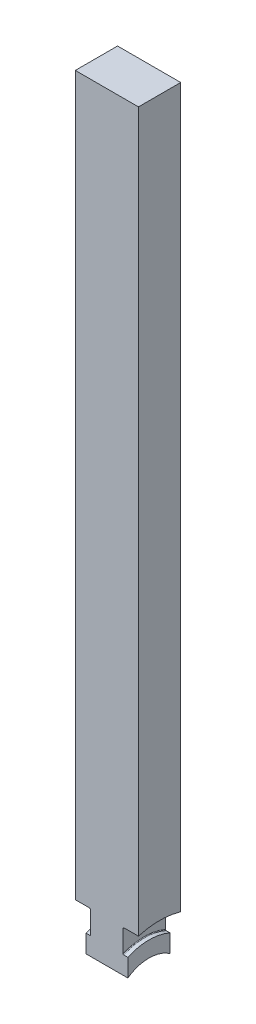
ISO-10303-21;
HEADER;
FILE_DESCRIPTION(('STEP AP214'),'2;1');
FILE_NAME('part.step','',(''),(''),'','','');
FILE_SCHEMA(('AUTOMOTIVE_DESIGN { 1 0 10303 214 1 1 1 1 }'));
ENDSEC;
DATA;
#1=APPLICATION_CONTEXT('core data for automotive mechanical design processes');
#2=APPLICATION_PROTOCOL_DEFINITION('international standard','automotive_design',2000,#1);
#3=PRODUCT_CONTEXT('',#1,'mechanical');
#4=PRODUCT('Part','Part','',(#3));
#5=PRODUCT_RELATED_PRODUCT_CATEGORY('part','',(#4));
#6=PRODUCT_DEFINITION_FORMATION('','',#4);
#7=PRODUCT_DEFINITION_CONTEXT('part definition',#1,'design');
#8=PRODUCT_DEFINITION('design','',#6,#7);
#9=PRODUCT_DEFINITION_SHAPE('','',#8);
#10=(LENGTH_UNIT() NAMED_UNIT(*) SI_UNIT(.MILLI.,.METRE.));
#11=(NAMED_UNIT(*) PLANE_ANGLE_UNIT() SI_UNIT($,.RADIAN.));
#12=(NAMED_UNIT(*) SI_UNIT($,.STERADIAN.) SOLID_ANGLE_UNIT());
#13=UNCERTAINTY_MEASURE_WITH_UNIT(LENGTH_MEASURE(1.E-05),#10,'distance_accuracy_value','');
#14=(GEOMETRIC_REPRESENTATION_CONTEXT(3) GLOBAL_UNCERTAINTY_ASSIGNED_CONTEXT((#13)) GLOBAL_UNIT_ASSIGNED_CONTEXT((#10,
#11,#12)) REPRESENTATION_CONTEXT('',''));
#15=CARTESIAN_POINT('',(0.,0.,0.));
#16=DIRECTION('',(0.,0.,1.));
#17=DIRECTION('',(1.,0.,0.));
#18=AXIS2_PLACEMENT_3D('',#15,#16,#17);
#19=CARTESIAN_POINT('',(19.177,479.425,12.827));
#20=DIRECTION('',(0.,0.,-1.));
#21=DIRECTION('',(0.,1.,0.));
#22=AXIS2_PLACEMENT_3D('',#19,#20,#21);
#23=PLANE('',#22);
#24=DIRECTION('',(-1.,0.,0.));
#25=VECTOR('',#24,1.);
#26=CARTESIAN_POINT('',(-8.84822894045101,29.043597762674,12.827));
#27=LINE('',#26,#25);
#28=CARTESIAN_POINT('',(-12.7,29.043597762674,12.827));
#29=VERTEX_POINT('',#28);
#30=CARTESIAN_POINT('',(-10.2362,29.043597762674,12.827));
#31=VERTEX_POINT('',#30);
#32=EDGE_CURVE('E196',#29,#31,#27,.F.);
#33=ORIENTED_EDGE('',*,*,#32,.F.);
#34=DIRECTION('',(0.,1.,0.));
#35=VECTOR('',#34,1.);
#36=CARTESIAN_POINT('',(-12.7,31.75,12.827));
#37=LINE('',#36,#35);
#38=CARTESIAN_POINT('',(-12.7,18.149895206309,12.827));
#39=VERTEX_POINT('',#38);
#40=EDGE_CURVE('E178',#39,#29,#37,.T.);
#41=ORIENTED_EDGE('',*,*,#40,.F.);
#42=DIRECTION('',(1.,0.,0.));
#43=VECTOR('',#42,1.);
#44=CARTESIAN_POINT('',(-19.177,18.1498952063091,12.827));
#45=LINE('',#44,#43);
#46=CARTESIAN_POINT('',(12.7,18.149895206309,12.827));
#47=VERTEX_POINT('',#46);
#48=EDGE_CURVE('E176',#39,#47,#45,.T.);
#49=ORIENTED_EDGE('',*,*,#48,.T.);
#50=DIRECTION('',(0.,-1.,0.));
#51=VECTOR('',#50,1.);
#52=CARTESIAN_POINT('',(12.7,31.75,12.827));
#53=LINE('',#52,#51);
#54=CARTESIAN_POINT('',(12.7,29.043597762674,12.827));
#55=VERTEX_POINT('',#54);
#56=EDGE_CURVE('E165',#55,#47,#53,.T.);
#57=ORIENTED_EDGE('',*,*,#56,.F.);
#58=DIRECTION('',(-1.,0.,0.));
#59=VECTOR('',#58,1.);
#60=CARTESIAN_POINT('',(-8.84822894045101,29.043597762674,12.827));
#61=LINE('',#60,#59);
#62=CARTESIAN_POINT('',(10.2362,29.043597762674,12.827));
#63=VERTEX_POINT('',#62);
#64=EDGE_CURVE('E152',#63,#55,#61,.F.);
#65=ORIENTED_EDGE('',*,*,#64,.F.);
#66=CARTESIAN_POINT('',(10.2362,29.043597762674,12.827));
#67=CARTESIAN_POINT('',(10.2160708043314,29.0435722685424,12.827));
#68=CARTESIAN_POINT('',(10.1959577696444,29.0453398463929,12.827));
#69=CARTESIAN_POINT('',(10.1563845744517,29.0522597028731,12.827));
#70=CARTESIAN_POINT('',(10.1369225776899,29.057401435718,12.827));
#71=CARTESIAN_POINT('',(10.0991468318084,29.0708679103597,12.827));
#72=CARTESIAN_POINT('',(10.0808326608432,29.0791914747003,12.827));
#73=CARTESIAN_POINT('',(10.0457902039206,29.0986936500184,12.827));
#74=CARTESIAN_POINT('',(10.0290627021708,29.1098736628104,12.827));
#75=CARTESIAN_POINT('',(9.99700861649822,29.1351379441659,12.827));
#76=CARTESIAN_POINT('',(9.98175149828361,29.1493101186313,12.827));
#77=CARTESIAN_POINT('',(9.95361671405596,29.1798419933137,12.827));
#78=CARTESIAN_POINT('',(9.9407396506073,29.1962022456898,12.827));
#79=CARTESIAN_POINT('',(9.91662869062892,29.2320467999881,12.827));
#80=CARTESIAN_POINT('',(9.90561137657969,29.2516766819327,12.827));
#81=CARTESIAN_POINT('',(9.8867485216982,29.2924113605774,12.827));
#82=CARTESIAN_POINT('',(9.87890468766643,29.3135169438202,12.827));
#83=CARTESIAN_POINT('',(9.86687995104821,29.3553145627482,12.827));
#84=CARTESIAN_POINT('',(9.86250087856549,29.375950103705,12.827));
#85=CARTESIAN_POINT('',(9.85666099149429,29.417597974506,12.827));
#86=CARTESIAN_POINT('',(9.85519567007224,29.4386096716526,12.827));
#87=CARTESIAN_POINT('',(9.8552,29.4596203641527,12.827));
#88=B_SPLINE_CURVE_WITH_KNOTS('',3,(#66,#67,#68,#69,#70,#71,#72,#73,#74,#75,#76,#77,#78,#79,#80,
#81,#82,#83,#84,#85,#86,#87),.UNSPECIFIED.,.F.,.F.,(4,2,2,2,2,2,2,2,2,2,4),(0.,
0.0602849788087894,0.120382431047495,0.180457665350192,0.240562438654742,0.302769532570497,
0.36499235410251,0.432238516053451,0.499520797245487,0.56260102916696,0.625583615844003),.UNSPECIFIED.);
#89=CARTESIAN_POINT('',(9.8552,29.4596203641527,12.827));
#90=VERTEX_POINT('',#89);
#91=EDGE_CURVE('E11',#63,#90,#88,.T.);
#92=ORIENTED_EDGE('',*,*,#91,.T.);
#93=DIRECTION('',(0.,-1.,0.));
#94=VECTOR('',#93,1.);
#95=CARTESIAN_POINT('',(9.8552,479.425,12.827));
#96=LINE('',#95,#94);
#97=CARTESIAN_POINT('',(9.8552,42.5855524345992,12.827));
#98=VERTEX_POINT('',#97);
#99=EDGE_CURVE('E211',#98,#90,#96,.T.);
#100=ORIENTED_EDGE('',*,*,#99,.F.);
#101=CARTESIAN_POINT('',(9.8552,42.5855524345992,12.827));
#102=CARTESIAN_POINT('',(9.85517024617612,42.6317662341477,12.827));
#103=CARTESIAN_POINT('',(9.85905310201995,42.6779817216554,12.827));
#104=CARTESIAN_POINT('',(9.87444611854,42.7691513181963,12.827));
#105=CARTESIAN_POINT('',(9.88596063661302,42.8141046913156,12.827));
#106=CARTESIAN_POINT('',(9.91643311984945,42.9014710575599,12.827));
#107=CARTESIAN_POINT('',(9.93539815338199,42.9438815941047,12.827));
#108=CARTESIAN_POINT('',(9.98032447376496,43.0247993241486,12.827));
#109=CARTESIAN_POINT('',(10.0062818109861,43.0633087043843,12.827));
#110=CARTESIAN_POINT('',(10.0639112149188,43.1343937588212,12.827));
#111=CARTESIAN_POINT('',(10.0954452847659,43.1670811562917,12.827));
#112=CARTESIAN_POINT('',(10.1637735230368,43.226428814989,12.827));
#113=CARTESIAN_POINT('',(10.200568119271,43.2530885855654,12.827));
#114=CARTESIAN_POINT('',(10.2767372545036,43.2984392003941,12.827));
#115=CARTESIAN_POINT('',(10.3159443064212,43.3174118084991,12.827));
#116=CARTESIAN_POINT('',(10.3970519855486,43.348201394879,12.827));
#117=CARTESIAN_POINT('',(10.438949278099,43.3600270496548,12.827));
#118=CARTESIAN_POINT('',(10.5038932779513,43.3722863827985,12.827));
#119=CARTESIAN_POINT('',(10.526453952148,43.3754629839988,12.827));
#120=CARTESIAN_POINT('',(10.571739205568,43.3796991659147,12.827));
#121=CARTESIAN_POINT('',(10.594463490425,43.3807618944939,12.827));
#122=CARTESIAN_POINT('',(10.6171999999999,43.3807610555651,12.827));
#123=B_SPLINE_CURVE_WITH_KNOTS('',3,(#101,#102,#103,#104,#105,#106,#107,#108,#109,#110,#111,
#112,#113,#114,#115,#116,#117,#118,#119,#120,#121,#122),.UNSPECIFIED.,.F.,.F.,(4,2,2,2,2,2,2,2,
2,2,4),(0.,0.138483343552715,0.277045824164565,0.415740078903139,0.554356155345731,
0.689928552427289,0.825511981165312,0.955539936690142,1.08540971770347,1.15367212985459,
1.22183281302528),.UNSPECIFIED.);
#124=CARTESIAN_POINT('',(10.6172,43.3807610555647,12.827));
#125=VERTEX_POINT('',#124);
#126=EDGE_CURVE('E295',#98,#125,#123,.T.);
#127=ORIENTED_EDGE('',*,*,#126,.T.);
#128=DIRECTION('',(-1.,0.,0.));
#129=VECTOR('',#128,1.);
#130=CARTESIAN_POINT('',(-8.84822894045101,43.3807610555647,12.827));
#131=LINE('',#130,#129);
#132=CARTESIAN_POINT('',(19.177,43.3807610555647,12.827));
#133=VERTEX_POINT('',#132);
#134=EDGE_CURVE('E206',#133,#125,#131,.T.);
#135=ORIENTED_EDGE('',*,*,#134,.F.);
#136=DIRECTION('',(0.,-1.,0.));
#137=VECTOR('',#136,1.);
#138=CARTESIAN_POINT('',(19.177,479.425,12.827));
#139=LINE('',#138,#137);
#140=CARTESIAN_POINT('',(19.177,479.425,12.827));
#141=VERTEX_POINT('',#140);
#142=EDGE_CURVE('E222',#141,#133,#139,.T.);
#143=ORIENTED_EDGE('',*,*,#142,.F.);
#144=DIRECTION('',(-1.,0.,0.));
#145=VECTOR('',#144,1.);
#146=CARTESIAN_POINT('',(19.177,479.425,12.827));
#147=LINE('',#146,#145);
#148=CARTESIAN_POINT('',(-19.177,479.425,12.827));
#149=VERTEX_POINT('',#148);
#150=EDGE_CURVE('E237',#141,#149,#147,.T.);
#151=ORIENTED_EDGE('',*,*,#150,.T.);
#152=DIRECTION('',(0.,-1.,0.));
#153=VECTOR('',#152,1.);
#154=CARTESIAN_POINT('',(-19.177,479.425,12.827));
#155=LINE('',#154,#153);
#156=CARTESIAN_POINT('',(-19.177,43.3807610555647,12.827));
#157=VERTEX_POINT('',#156);
#158=EDGE_CURVE('E231',#149,#157,#155,.T.);
#159=ORIENTED_EDGE('',*,*,#158,.T.);
#160=DIRECTION('',(-1.,0.,0.));
#161=VECTOR('',#160,1.);
#162=CARTESIAN_POINT('',(-8.84822894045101,43.3807610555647,12.827));
#163=LINE('',#162,#161);
#164=CARTESIAN_POINT('',(-10.6172,43.3807610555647,12.827));
#165=VERTEX_POINT('',#164);
#166=EDGE_CURVE('E202',#165,#157,#163,.T.);
#167=ORIENTED_EDGE('',*,*,#166,.F.);
#168=CARTESIAN_POINT('',(-10.6172,43.3807610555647,12.827));
#169=CARTESIAN_POINT('',(-10.5756065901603,43.3808045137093,12.827));
#170=CARTESIAN_POINT('',(-10.5340342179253,43.3772126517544,12.827));
#171=CARTESIAN_POINT('',(-10.4521637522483,43.363091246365,12.827));
#172=CARTESIAN_POINT('',(-10.411863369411,43.3525750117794,12.827));
#173=CARTESIAN_POINT('',(-10.3335975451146,43.3249343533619,12.827));
#174=CARTESIAN_POINT('',(-10.295632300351,43.3078093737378,12.827));
#175=CARTESIAN_POINT('',(-10.223045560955,43.2675367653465,12.827));
#176=CARTESIAN_POINT('',(-10.1884245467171,43.2443882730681,12.827));
#177=CARTESIAN_POINT('',(-10.1228284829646,43.1923475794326,12.827));
#178=CARTESIAN_POINT('',(-10.0919268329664,43.1633629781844,12.827));
#179=CARTESIAN_POINT('',(-10.0352031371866,43.1007883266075,12.827));
#180=CARTESIAN_POINT('',(-10.0093823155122,43.0671971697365,12.827));
#181=CARTESIAN_POINT('',(-9.96248271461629,42.9949745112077,12.827));
#182=CARTESIAN_POINT('',(-9.9416282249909,42.9561975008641,12.827));
#183=CARTESIAN_POINT('',(-9.90645002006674,42.8757858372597,12.827));
#184=CARTESIAN_POINT('',(-9.89212634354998,42.8341511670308,12.827));
#185=CARTESIAN_POINT('',(-9.87256356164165,42.7580053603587,12.827));
#186=CARTESIAN_POINT('',(-9.86605461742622,42.7238136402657,12.827));
#187=CARTESIAN_POINT('',(-9.85737265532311,42.6549344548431,12.827));
#188=CARTESIAN_POINT('',(-9.85519333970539,42.6202477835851,12.827));
#189=CARTESIAN_POINT('',(-9.85520000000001,42.5855524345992,12.827));
#190=B_SPLINE_CURVE_WITH_KNOTS('',3,(#168,#169,#170,#171,#172,#173,#174,#175,#176,#177,#178,
#179,#180,#181,#182,#183,#184,#185,#186,#187,#188,#189),.UNSPECIFIED.,.F.,.F.,(4,2,2,2,2,2,2,2,
2,2,4),(0.,0.124593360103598,0.248947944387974,0.373312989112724,0.497695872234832,
0.624229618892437,0.750793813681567,0.882295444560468,1.01379785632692,1.11794997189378,
1.22195048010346),.UNSPECIFIED.);
#191=CARTESIAN_POINT('',(-9.85520000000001,42.5855524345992,12.827));
#192=VERTEX_POINT('',#191);
#193=EDGE_CURVE('E264',#165,#192,#190,.T.);
#194=ORIENTED_EDGE('',*,*,#193,.T.);
#195=DIRECTION('',(0.,1.,0.));
#196=VECTOR('',#195,1.);
#197=CARTESIAN_POINT('',(-9.85520000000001,479.425,12.827));
#198=LINE('',#197,#196);
#199=CARTESIAN_POINT('',(-9.85520000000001,29.4596203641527,12.827));
#200=VERTEX_POINT('',#199);
#201=EDGE_CURVE('E160',#200,#192,#198,.T.);
#202=ORIENTED_EDGE('',*,*,#201,.F.);
#203=CARTESIAN_POINT('',(-9.85520000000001,29.4596203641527,12.827));
#204=CARTESIAN_POINT('',(-9.85518989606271,29.4345722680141,12.827));
#205=CARTESIAN_POINT('',(-9.85727632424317,29.4095174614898,12.827));
#206=CARTESIAN_POINT('',(-9.86557747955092,29.3600490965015,12.827));
#207=CARTESIAN_POINT('',(-9.87180075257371,29.3356369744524,12.827));
#208=CARTESIAN_POINT('',(-9.8883214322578,29.2881862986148,12.827));
#209=CARTESIAN_POINT('',(-9.89862433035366,29.2651496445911,12.827));
#210=CARTESIAN_POINT('',(-9.92312499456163,29.2212642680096,12.827));
#211=CARTESIAN_POINT('',(-9.93731902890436,29.2004134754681,12.827));
#212=CARTESIAN_POINT('',(-9.96856972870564,29.1625759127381,12.827));
#213=CARTESIAN_POINT('',(-9.98546338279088,29.145454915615,12.827));
#214=CARTESIAN_POINT('',(-10.0221325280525,29.1146162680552,12.827));
#215=CARTESIAN_POINT('',(-10.0419075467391,29.1008980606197,12.827));
#216=CARTESIAN_POINT('',(-10.081919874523,29.0785475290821,12.827));
#217=CARTESIAN_POINT('',(-10.1019691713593,29.0695778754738,12.827));
#218=CARTESIAN_POINT('',(-10.1433538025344,29.0554628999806,12.827));
#219=CARTESIAN_POINT('',(-10.1646864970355,29.0503099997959,12.827));
#220=CARTESIAN_POINT('',(-10.1945530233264,29.0459922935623,12.827));
#221=CARTESIAN_POINT('',(-10.2028633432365,29.0450944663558,12.827));
#222=CARTESIAN_POINT('',(-10.2195142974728,29.0438978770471,12.827));
#223=CARTESIAN_POINT('',(-10.2278548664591,29.0435982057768,12.827));
#224=CARTESIAN_POINT('',(-10.2362,29.043597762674,12.827));
#225=B_SPLINE_CURVE_WITH_KNOTS('',3,(#203,#204,#205,#206,#207,#208,#209,#210,#211,#212,#213,
#214,#215,#216,#217,#218,#219,#220,#221,#222,#223,#224),.UNSPECIFIED.,.F.,.F.,(4,2,2,2,2,2,2,2,
2,2,4),(0.,0.0750698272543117,0.150295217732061,0.225622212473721,0.3008772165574,
0.372647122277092,0.444405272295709,0.509955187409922,0.575374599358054,0.60043367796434,
0.625454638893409),.UNSPECIFIED.);
#226=EDGE_CURVE('E309',#200,#31,#225,.T.);
#227=ORIENTED_EDGE('',*,*,#226,.T.);
#228=EDGE_LOOP('',(#33,#41,#49,#57,#65,#92,#100,#127,#135,#143,#151,#159,#167,#194,#202,#227));
#229=FACE_BOUND('',#228,.T.);
#230=ADVANCED_FACE('F37',(#229),#23,.F.);
#231=CARTESIAN_POINT('',(19.177,479.425,-12.827));
#232=DIRECTION('',(0.,0.,1.));
#233=DIRECTION('',(0.,-1.,0.));
#234=AXIS2_PLACEMENT_3D('',#231,#232,#233);
#235=PLANE('',#234);
#236=DIRECTION('',(1.,0.,0.));
#237=VECTOR('',#236,1.);
#238=CARTESIAN_POINT('',(-19.177,18.149895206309,-12.827));
#239=LINE('',#238,#237);
#240=CARTESIAN_POINT('',(12.7,18.149895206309,-12.827));
#241=VERTEX_POINT('',#240);
#242=CARTESIAN_POINT('',(-12.7,18.149895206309,-12.827));
#243=VERTEX_POINT('',#242);
#244=EDGE_CURVE('E214',#241,#243,#239,.F.);
#245=ORIENTED_EDGE('',*,*,#244,.T.);
#246=DIRECTION('',(0.,1.,0.));
#247=VECTOR('',#246,1.);
#248=CARTESIAN_POINT('',(-12.7,31.75,-12.827));
#249=LINE('',#248,#247);
#250=CARTESIAN_POINT('',(-12.7,29.043597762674,-12.827));
#251=VERTEX_POINT('',#250);
#252=EDGE_CURVE('E181',#243,#251,#249,.T.);
#253=ORIENTED_EDGE('',*,*,#252,.T.);
#254=DIRECTION('',(-1.,0.,0.));
#255=VECTOR('',#254,1.);
#256=CARTESIAN_POINT('',(-8.84822894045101,29.043597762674,-12.827));
#257=LINE('',#256,#255);
#258=CARTESIAN_POINT('',(-10.2362,29.043597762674,-12.827));
#259=VERTEX_POINT('',#258);
#260=EDGE_CURVE('E193',#259,#251,#257,.T.);
#261=ORIENTED_EDGE('',*,*,#260,.F.);
#262=CARTESIAN_POINT('',(-10.2362,29.043597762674,-12.827));
#263=CARTESIAN_POINT('',(-10.2160708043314,29.0435722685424,-12.827));
#264=CARTESIAN_POINT('',(-10.1959577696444,29.0453398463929,-12.827));
#265=CARTESIAN_POINT('',(-10.1563845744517,29.0522597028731,-12.827));
#266=CARTESIAN_POINT('',(-10.1369225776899,29.0574014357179,-12.827));
#267=CARTESIAN_POINT('',(-10.0991468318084,29.0708679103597,-12.827));
#268=CARTESIAN_POINT('',(-10.0808326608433,29.0791914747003,-12.827));
#269=CARTESIAN_POINT('',(-10.0457902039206,29.0986936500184,-12.827));
#270=CARTESIAN_POINT('',(-10.0290627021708,29.1098736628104,-12.827));
#271=CARTESIAN_POINT('',(-9.99700861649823,29.1351379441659,-12.827));
#272=CARTESIAN_POINT('',(-9.98175149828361,29.1493101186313,-12.827));
#273=CARTESIAN_POINT('',(-9.95361671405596,29.1798419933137,-12.827));
#274=CARTESIAN_POINT('',(-9.94073965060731,29.1962022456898,-12.827));
#275=CARTESIAN_POINT('',(-9.91662869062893,29.2320467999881,-12.827));
#276=CARTESIAN_POINT('',(-9.9056113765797,29.2516766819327,-12.827));
#277=CARTESIAN_POINT('',(-9.88674852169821,29.2924113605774,-12.827));
#278=CARTESIAN_POINT('',(-9.87890468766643,29.3135169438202,-12.827));
#279=CARTESIAN_POINT('',(-9.86687995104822,29.3553145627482,-12.827));
#280=CARTESIAN_POINT('',(-9.86250087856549,29.375950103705,-12.827));
#281=CARTESIAN_POINT('',(-9.85666099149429,29.4175979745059,-12.827));
#282=CARTESIAN_POINT('',(-9.85519567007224,29.4386096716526,-12.827));
#283=CARTESIAN_POINT('',(-9.85520000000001,29.4596203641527,-12.827));
#284=B_SPLINE_CURVE_WITH_KNOTS('',3,(#262,#263,#264,#265,#266,#267,#268,#269,#270,#271,#272,
#273,#274,#275,#276,#277,#278,#279,#280,#281,#282,#283),.UNSPECIFIED.,.F.,.F.,(4,2,2,2,2,2,2,2,
2,2,4),(0.,0.0602849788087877,0.120382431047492,0.180457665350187,0.240562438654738,
0.302769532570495,0.364992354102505,0.432238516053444,0.49952079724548,0.562601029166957,
0.625583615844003),.UNSPECIFIED.);
#285=CARTESIAN_POINT('',(-9.85520000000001,29.4596203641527,-12.827));
#286=VERTEX_POINT('',#285);
#287=EDGE_CURVE('E315',#259,#286,#284,.T.);
#288=ORIENTED_EDGE('',*,*,#287,.T.);
#289=DIRECTION('',(0.,-1.,0.));
#290=VECTOR('',#289,1.);
#291=CARTESIAN_POINT('',(-9.85520000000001,479.425,-12.827));
#292=LINE('',#291,#290);
#293=CARTESIAN_POINT('',(-9.85520000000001,42.5855524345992,-12.827));
#294=VERTEX_POINT('',#293);
#295=EDGE_CURVE('E240',#294,#286,#292,.T.);
#296=ORIENTED_EDGE('',*,*,#295,.F.);
#297=CARTESIAN_POINT('',(-9.85520000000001,42.5855524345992,-12.827));
#298=CARTESIAN_POINT('',(-9.85517024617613,42.6317662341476,-12.827));
#299=CARTESIAN_POINT('',(-9.85905310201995,42.6779817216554,-12.827));
#300=CARTESIAN_POINT('',(-9.87444611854,42.7691513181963,-12.827));
#301=CARTESIAN_POINT('',(-9.88596063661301,42.8141046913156,-12.827));
#302=CARTESIAN_POINT('',(-9.91643311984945,42.9014710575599,-12.827));
#303=CARTESIAN_POINT('',(-9.93539815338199,42.9438815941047,-12.827));
#304=CARTESIAN_POINT('',(-9.98032447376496,43.0247993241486,-12.827));
#305=CARTESIAN_POINT('',(-10.0062818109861,43.0633087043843,-12.827));
#306=CARTESIAN_POINT('',(-10.0639112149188,43.1343937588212,-12.827));
#307=CARTESIAN_POINT('',(-10.0954452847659,43.1670811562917,-12.827));
#308=CARTESIAN_POINT('',(-10.1637735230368,43.226428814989,-12.827));
#309=CARTESIAN_POINT('',(-10.200568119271,43.2530885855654,-12.827));
#310=CARTESIAN_POINT('',(-10.2767372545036,43.2984392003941,-12.827));
#311=CARTESIAN_POINT('',(-10.3159443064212,43.3174118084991,-12.827));
#312=CARTESIAN_POINT('',(-10.3970519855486,43.348201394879,-12.827));
#313=CARTESIAN_POINT('',(-10.438949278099,43.3600270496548,-12.827));
#314=CARTESIAN_POINT('',(-10.5038932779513,43.3722863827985,-12.827));
#315=CARTESIAN_POINT('',(-10.526453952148,43.3754629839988,-12.827));
#316=CARTESIAN_POINT('',(-10.571739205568,43.3796991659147,-12.827));
#317=CARTESIAN_POINT('',(-10.594463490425,43.3807618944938,-12.827));
#318=CARTESIAN_POINT('',(-10.6171999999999,43.3807610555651,-12.827));
#319=B_SPLINE_CURVE_WITH_KNOTS('',3,(#297,#298,#299,#300,#301,#302,#303,#304,#305,#306,#307,
#308,#309,#310,#311,#312,#313,#314,#315,#316,#317,#318),.UNSPECIFIED.,.F.,.F.,(4,2,2,2,2,2,2,2,
2,2,4),(0.,0.138483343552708,0.277045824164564,0.415740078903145,0.554356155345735,
0.689928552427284,0.825511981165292,0.955539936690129,1.08540971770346,1.15367212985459,
1.22183281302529),.UNSPECIFIED.);
#320=CARTESIAN_POINT('',(-10.6172,43.3807610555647,-12.827));
#321=VERTEX_POINT('',#320);
#322=EDGE_CURVE('E256',#294,#321,#319,.T.);
#323=ORIENTED_EDGE('',*,*,#322,.T.);
#324=DIRECTION('',(-1.,0.,0.));
#325=VECTOR('',#324,1.);
#326=CARTESIAN_POINT('',(-8.84822894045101,43.3807610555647,-12.827));
#327=LINE('',#326,#325);
#328=CARTESIAN_POINT('',(-19.177,43.3807610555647,-12.827));
#329=VERTEX_POINT('',#328);
#330=EDGE_CURVE('E199',#329,#321,#327,.F.);
#331=ORIENTED_EDGE('',*,*,#330,.F.);
#332=DIRECTION('',(0.,1.,0.));
#333=VECTOR('',#332,1.);
#334=CARTESIAN_POINT('',(-19.177,479.425,-12.827));
#335=LINE('',#334,#333);
#336=CARTESIAN_POINT('',(-19.177,479.425,-12.827));
#337=VERTEX_POINT('',#336);
#338=EDGE_CURVE('E223',#329,#337,#335,.T.);
#339=ORIENTED_EDGE('',*,*,#338,.T.);
#340=DIRECTION('',(-1.,0.,0.));
#341=VECTOR('',#340,1.);
#342=CARTESIAN_POINT('',(19.177,479.425,-12.827));
#343=LINE('',#342,#341);
#344=CARTESIAN_POINT('',(19.177,479.425,-12.827));
#345=VERTEX_POINT('',#344);
#346=EDGE_CURVE('E228',#345,#337,#343,.T.);
#347=ORIENTED_EDGE('',*,*,#346,.F.);
#348=DIRECTION('',(0.,1.,0.));
#349=VECTOR('',#348,1.);
#350=CARTESIAN_POINT('',(19.177,479.425,-12.827));
#351=LINE('',#350,#349);
#352=CARTESIAN_POINT('',(19.177,43.3807610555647,-12.827));
#353=VERTEX_POINT('',#352);
#354=EDGE_CURVE('E226',#353,#345,#351,.T.);
#355=ORIENTED_EDGE('',*,*,#354,.F.);
#356=DIRECTION('',(-1.,0.,0.));
#357=VECTOR('',#356,1.);
#358=CARTESIAN_POINT('',(-8.84822894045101,43.3807610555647,-12.827));
#359=LINE('',#358,#357);
#360=CARTESIAN_POINT('',(10.6172,43.3807610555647,-12.827));
#361=VERTEX_POINT('',#360);
#362=EDGE_CURVE('E204',#361,#353,#359,.F.);
#363=ORIENTED_EDGE('',*,*,#362,.F.);
#364=CARTESIAN_POINT('',(10.6172,43.3807610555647,-12.827));
#365=CARTESIAN_POINT('',(10.5756065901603,43.3808045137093,-12.827));
#366=CARTESIAN_POINT('',(10.5340342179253,43.3772126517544,-12.827));
#367=CARTESIAN_POINT('',(10.4521637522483,43.363091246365,-12.827));
#368=CARTESIAN_POINT('',(10.411863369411,43.3525750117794,-12.827));
#369=CARTESIAN_POINT('',(10.3335975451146,43.3249343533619,-12.827));
#370=CARTESIAN_POINT('',(10.295632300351,43.3078093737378,-12.827));
#371=CARTESIAN_POINT('',(10.223045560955,43.2675367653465,-12.827));
#372=CARTESIAN_POINT('',(10.1884245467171,43.2443882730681,-12.827));
#373=CARTESIAN_POINT('',(10.1228284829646,43.1923475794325,-12.827));
#374=CARTESIAN_POINT('',(10.0919268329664,43.1633629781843,-12.827));
#375=CARTESIAN_POINT('',(10.0352031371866,43.1007883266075,-12.827));
#376=CARTESIAN_POINT('',(10.0093823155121,43.0671971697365,-12.827));
#377=CARTESIAN_POINT('',(9.96248271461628,42.9949745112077,-12.827));
#378=CARTESIAN_POINT('',(9.9416282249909,42.9561975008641,-12.827));
#379=CARTESIAN_POINT('',(9.90645002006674,42.8757858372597,-12.827));
#380=CARTESIAN_POINT('',(9.89212634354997,42.8341511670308,-12.827));
#381=CARTESIAN_POINT('',(9.87256356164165,42.7580053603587,-12.827));
#382=CARTESIAN_POINT('',(9.86605461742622,42.7238136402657,-12.827));
#383=CARTESIAN_POINT('',(9.85737265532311,42.6549344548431,-12.827));
#384=CARTESIAN_POINT('',(9.85519333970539,42.6202477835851,-12.827));
#385=CARTESIAN_POINT('',(9.8552,42.5855524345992,-12.827));
#386=B_SPLINE_CURVE_WITH_KNOTS('',3,(#364,#365,#366,#367,#368,#369,#370,#371,#372,#373,#374,
#375,#376,#377,#378,#379,#380,#381,#382,#383,#384,#385),.UNSPECIFIED.,.F.,.F.,(4,2,2,2,2,2,2,2,
2,2,4),(0.,0.1245933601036,0.248947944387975,0.373312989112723,0.497695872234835,
0.624229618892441,0.750793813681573,0.88229544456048,1.01379785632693,1.11794997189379,
1.22195048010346),.UNSPECIFIED.);
#387=CARTESIAN_POINT('',(9.8552,42.5855524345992,-12.827));
#388=VERTEX_POINT('',#387);
#389=EDGE_CURVE('E289',#361,#388,#386,.T.);
#390=ORIENTED_EDGE('',*,*,#389,.T.);
#391=DIRECTION('',(0.,1.,0.));
#392=VECTOR('',#391,1.);
#393=CARTESIAN_POINT('',(9.8552,479.425,-12.827));
#394=LINE('',#393,#392);
#395=CARTESIAN_POINT('',(9.8552,29.4596203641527,-12.827));
#396=VERTEX_POINT('',#395);
#397=EDGE_CURVE('E170',#396,#388,#394,.T.);
#398=ORIENTED_EDGE('',*,*,#397,.F.);
#399=CARTESIAN_POINT('',(9.8552,29.4596203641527,-12.827));
#400=CARTESIAN_POINT('',(9.85518989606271,29.434572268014,-12.827));
#401=CARTESIAN_POINT('',(9.85727632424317,29.4095174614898,-12.827));
#402=CARTESIAN_POINT('',(9.86557747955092,29.3600490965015,-12.827));
#403=CARTESIAN_POINT('',(9.87180075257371,29.3356369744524,-12.827));
#404=CARTESIAN_POINT('',(9.8883214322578,29.2881862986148,-12.827));
#405=CARTESIAN_POINT('',(9.89862433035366,29.2651496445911,-12.827));
#406=CARTESIAN_POINT('',(9.92312499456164,29.2212642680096,-12.827));
#407=CARTESIAN_POINT('',(9.93731902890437,29.200413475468,-12.827));
#408=CARTESIAN_POINT('',(9.96856972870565,29.1625759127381,-12.827));
#409=CARTESIAN_POINT('',(9.98546338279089,29.145454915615,-12.827));
#410=CARTESIAN_POINT('',(10.0221325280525,29.1146162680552,-12.827));
#411=CARTESIAN_POINT('',(10.0419075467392,29.1008980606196,-12.827));
#412=CARTESIAN_POINT('',(10.081919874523,29.0785475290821,-12.827));
#413=CARTESIAN_POINT('',(10.1019691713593,29.0695778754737,-12.827));
#414=CARTESIAN_POINT('',(10.1433538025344,29.0554628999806,-12.827));
#415=CARTESIAN_POINT('',(10.1646864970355,29.0503099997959,-12.827));
#416=CARTESIAN_POINT('',(10.1945530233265,29.0459922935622,-12.827));
#417=CARTESIAN_POINT('',(10.2028633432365,29.0450944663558,-12.827));
#418=CARTESIAN_POINT('',(10.2195142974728,29.043897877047,-12.827));
#419=CARTESIAN_POINT('',(10.2278548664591,29.0435982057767,-12.827));
#420=CARTESIAN_POINT('',(10.2362,29.0435977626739,-12.827));
#421=B_SPLINE_CURVE_WITH_KNOTS('',3,(#399,#400,#401,#402,#403,#404,#405,#406,#407,#408,#409,
#410,#411,#412,#413,#414,#415,#416,#417,#418,#419,#420),.UNSPECIFIED.,.F.,.F.,(4,2,2,2,2,2,2,2,
2,2,4),(0.,0.0750698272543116,0.150295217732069,0.225622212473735,0.300877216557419,
0.372647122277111,0.444405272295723,0.509955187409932,0.575374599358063,0.600433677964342,
0.625454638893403),.UNSPECIFIED.);
#422=CARTESIAN_POINT('',(10.2362,29.043597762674,-12.827));
#423=VERTEX_POINT('',#422);
#424=EDGE_CURVE('E51',#396,#423,#421,.T.);
#425=ORIENTED_EDGE('',*,*,#424,.T.);
#426=DIRECTION('',(-1.,0.,0.));
#427=VECTOR('',#426,1.);
#428=CARTESIAN_POINT('',(-8.84822894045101,29.043597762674,-12.827));
#429=LINE('',#428,#427);
#430=CARTESIAN_POINT('',(12.7,29.043597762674,-12.827));
#431=VERTEX_POINT('',#430);
#432=EDGE_CURVE('E161',#431,#423,#429,.T.);
#433=ORIENTED_EDGE('',*,*,#432,.F.);
#434=DIRECTION('',(0.,-1.,0.));
#435=VECTOR('',#434,1.);
#436=CARTESIAN_POINT('',(12.7,31.75,-12.827));
#437=LINE('',#436,#435);
#438=EDGE_CURVE('E168',#431,#241,#437,.T.);
#439=ORIENTED_EDGE('',*,*,#438,.T.);
#440=EDGE_LOOP('',(#245,#253,#261,#288,#296,#323,#331,#339,#347,#355,#363,#390,#398,#425,#433,#439));
#441=FACE_BOUND('',#440,.T.);
#442=ADVANCED_FACE('F270',(#441),#235,.F.);
#443=CARTESIAN_POINT('',(-19.177,0.,0.));
#444=DIRECTION('',(-1.,0.,0.));
#445=DIRECTION('',(0.,0.,1.));
#446=AXIS2_PLACEMENT_3D('',#443,#444,#445);
#447=PLANE('',#446);
#448=ORIENTED_EDGE('',*,*,#338,.F.);
#449=CARTESIAN_POINT('',(-19.177,0.,0.));
#450=DIRECTION('',(-1.,0.,0.));
#451=DIRECTION('',(0.,0.,1.));
#452=AXIS2_PLACEMENT_3D('',#449,#450,#451);
#453=CIRCLE('',#452,45.2374);
#454=EDGE_CURVE('E189',#157,#329,#453,.T.);
#455=ORIENTED_EDGE('',*,*,#454,.F.);
#456=ORIENTED_EDGE('',*,*,#158,.F.);
#457=DIRECTION('',(0.,0.,1.));
#458=VECTOR('',#457,1.);
#459=CARTESIAN_POINT('',(-19.177,479.425,12.827));
#460=LINE('',#459,#458);
#461=EDGE_CURVE('E218',#337,#149,#460,.T.);
#462=ORIENTED_EDGE('',*,*,#461,.F.);
#463=EDGE_LOOP('',(#448,#455,#456,#462));
#464=FACE_BOUND('',#463,.T.);
#465=ADVANCED_FACE('F378',(#464),#447,.T.);
#466=CARTESIAN_POINT('',(19.177,479.425,12.827));
#467=DIRECTION('',(0.,-1.,0.));
#468=DIRECTION('',(0.,0.,-1.));
#469=AXIS2_PLACEMENT_3D('',#466,#467,#468);
#470=PLANE('',#469);
#471=ORIENTED_EDGE('',*,*,#461,.T.);
#472=ORIENTED_EDGE('',*,*,#150,.F.);
#473=DIRECTION('',(0.,0.,1.));
#474=VECTOR('',#473,1.);
#475=CARTESIAN_POINT('',(19.177,479.425,12.827));
#476=LINE('',#475,#474);
#477=EDGE_CURVE('E219',#345,#141,#476,.T.);
#478=ORIENTED_EDGE('',*,*,#477,.F.);
#479=ORIENTED_EDGE('',*,*,#346,.T.);
#480=EDGE_LOOP('',(#471,#472,#478,#479));
#481=FACE_BOUND('',#480,.T.);
#482=ADVANCED_FACE('F281',(#481),#470,.F.);
#483=CARTESIAN_POINT('',(19.177,0.,0.));
#484=DIRECTION('',(-1.,0.,0.));
#485=DIRECTION('',(0.,0.,1.));
#486=AXIS2_PLACEMENT_3D('',#483,#484,#485);
#487=PLANE('',#486);
#488=CARTESIAN_POINT('',(19.177,0.,0.));
#489=DIRECTION('',(-1.,0.,0.));
#490=DIRECTION('',(0.,0.,1.));
#491=AXIS2_PLACEMENT_3D('',#488,#489,#490);
#492=CIRCLE('',#491,45.2374);
#493=EDGE_CURVE('E190',#133,#353,#492,.T.);
#494=ORIENTED_EDGE('',*,*,#493,.T.);
#495=ORIENTED_EDGE('',*,*,#354,.T.);
#496=ORIENTED_EDGE('',*,*,#477,.T.);
#497=ORIENTED_EDGE('',*,*,#142,.T.);
#498=EDGE_LOOP('',(#494,#495,#496,#497));
#499=FACE_BOUND('',#498,.T.);
#500=ADVANCED_FACE('F366',(#499),#487,.F.);
#501=CARTESIAN_POINT('',(-19.177,0.,0.));
#502=DIRECTION('',(1.,0.,0.));
#503=DIRECTION('',(0.,0.,-1.));
#504=AXIS2_PLACEMENT_3D('',#501,#502,#503);
#505=CYLINDRICAL_SURFACE('',#504,22.225);
#506=ORIENTED_EDGE('',*,*,#48,.F.);
#507=CARTESIAN_POINT('',(-12.7,0.,0.));
#508=DIRECTION('',(1.,0.,0.));
#509=DIRECTION('',(0.,1.,0.));
#510=AXIS2_PLACEMENT_3D('',#507,#508,#509);
#511=CIRCLE('',#510,22.225);
#512=EDGE_CURVE('E186',#39,#243,#511,.F.);
#513=ORIENTED_EDGE('',*,*,#512,.T.);
#514=ORIENTED_EDGE('',*,*,#244,.F.);
#515=CARTESIAN_POINT('',(12.7,0.,0.));
#516=DIRECTION('',(-1.,0.,0.));
#517=DIRECTION('',(0.,-1.,0.));
#518=AXIS2_PLACEMENT_3D('',#515,#516,#517);
#519=CIRCLE('',#518,22.225);
#520=EDGE_CURVE('E184',#241,#47,#519,.F.);
#521=ORIENTED_EDGE('',*,*,#520,.T.);
#522=EDGE_LOOP('',(#506,#513,#514,#521));
#523=FACE_BOUND('',#522,.T.);
#524=ADVANCED_FACE('F385',(#523),#505,.F.);
#525=CARTESIAN_POINT('',(-9.85520000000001,31.75,0.));
#526=DIRECTION('',(-1.,0.,0.));
#527=DIRECTION('',(0.,0.,1.));
#528=AXIS2_PLACEMENT_3D('',#525,#526,#527);
#529=PLANE('',#528);
#530=ORIENTED_EDGE('',*,*,#295,.T.);
#531=CARTESIAN_POINT('',(-9.85520000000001,0.,0.));
#532=DIRECTION('',(-1.,0.,0.));
#533=DIRECTION('',(0.,0.,1.));
#534=AXIS2_PLACEMENT_3D('',#531,#532,#533);
#535=CIRCLE('',#534,32.131);
#536=EDGE_CURVE('E328',#286,#200,#535,.F.);
#537=ORIENTED_EDGE('',*,*,#536,.T.);
#538=ORIENTED_EDGE('',*,*,#201,.T.);
#539=CARTESIAN_POINT('',(-9.85520000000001,0.,0.));
#540=DIRECTION('',(-1.,0.,0.));
#541=DIRECTION('',(0.,0.,1.));
#542=AXIS2_PLACEMENT_3D('',#539,#540,#541);
#543=CIRCLE('',#542,44.4754);
#544=EDGE_CURVE('E246',#192,#294,#543,.T.);
#545=ORIENTED_EDGE('',*,*,#544,.T.);
#546=EDGE_LOOP('',(#530,#537,#538,#545));
#547=FACE_BOUND('',#546,.T.);
#548=ADVANCED_FACE('F383',(#547),#529,.T.);
#549=CARTESIAN_POINT('',(-8.84822894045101,0.,0.));
#550=DIRECTION('',(-1.,0.,0.));
#551=DIRECTION('',(0.,0.,1.));
#552=AXIS2_PLACEMENT_3D('',#549,#550,#551);
#553=CYLINDRICAL_SURFACE('',#552,45.2374);
#554=ORIENTED_EDGE('',*,*,#330,.T.);
#555=CARTESIAN_POINT('',(-10.6172,0.,0.));
#556=DIRECTION('',(-1.,0.,0.));
#557=DIRECTION('',(0.,0.,1.));
#558=AXIS2_PLACEMENT_3D('',#555,#556,#557);
#559=CIRCLE('',#558,45.2374);
#560=EDGE_CURVE('E249',#321,#165,#559,.F.);
#561=ORIENTED_EDGE('',*,*,#560,.T.);
#562=ORIENTED_EDGE('',*,*,#166,.T.);
#563=ORIENTED_EDGE('',*,*,#454,.T.);
#564=EDGE_LOOP('',(#554,#561,#562,#563));
#565=FACE_BOUND('',#564,.T.);
#566=ADVANCED_FACE('F380',(#565),#553,.F.);
#567=CARTESIAN_POINT('',(-8.84822894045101,0.,0.));
#568=DIRECTION('',(-1.,0.,0.));
#569=DIRECTION('',(0.,0.,1.));
#570=AXIS2_PLACEMENT_3D('',#567,#568,#569);
#571=CYLINDRICAL_SURFACE('',#570,31.75);
#572=ORIENTED_EDGE('',*,*,#32,.T.);
#573=CARTESIAN_POINT('',(-10.2362,0.,0.));
#574=DIRECTION('',(-1.,0.,0.));
#575=DIRECTION('',(0.,0.,1.));
#576=AXIS2_PLACEMENT_3D('',#573,#574,#575);
#577=CIRCLE('',#576,31.75);
#578=EDGE_CURVE('E301',#31,#259,#577,.T.);
#579=ORIENTED_EDGE('',*,*,#578,.T.);
#580=ORIENTED_EDGE('',*,*,#260,.T.);
#581=CARTESIAN_POINT('',(-12.7,0.,0.));
#582=DIRECTION('',(1.,0.,0.));
#583=DIRECTION('',(0.,1.,0.));
#584=AXIS2_PLACEMENT_3D('',#581,#582,#583);
#585=CIRCLE('',#584,31.75);
#586=EDGE_CURVE('E169',#29,#251,#585,.F.);
#587=ORIENTED_EDGE('',*,*,#586,.F.);
#588=EDGE_LOOP('',(#572,#579,#580,#587));
#589=FACE_BOUND('',#588,.T.);
#590=ADVANCED_FACE('F336',(#589),#571,.T.);
#591=CARTESIAN_POINT('',(9.8552,31.75,0.));
#592=DIRECTION('',(1.,0.,0.));
#593=DIRECTION('',(0.,0.,-1.));
#594=AXIS2_PLACEMENT_3D('',#591,#592,#593);
#595=PLANE('',#594);
#596=ORIENTED_EDGE('',*,*,#99,.T.);
#597=CARTESIAN_POINT('',(9.8552,0.,0.));
#598=DIRECTION('',(1.,0.,0.));
#599=DIRECTION('',(0.,0.,-1.));
#600=AXIS2_PLACEMENT_3D('',#597,#598,#599);
#601=CIRCLE('',#600,32.131);
#602=EDGE_CURVE('E326',#90,#396,#601,.F.);
#603=ORIENTED_EDGE('',*,*,#602,.T.);
#604=ORIENTED_EDGE('',*,*,#397,.T.);
#605=CARTESIAN_POINT('',(9.8552,0.,0.));
#606=DIRECTION('',(1.,0.,0.));
#607=DIRECTION('',(0.,0.,-1.));
#608=AXIS2_PLACEMENT_3D('',#605,#606,#607);
#609=CIRCLE('',#608,44.4754);
#610=EDGE_CURVE('E254',#388,#98,#609,.T.);
#611=ORIENTED_EDGE('',*,*,#610,.T.);
#612=EDGE_LOOP('',(#596,#603,#604,#611));
#613=FACE_BOUND('',#612,.T.);
#614=ADVANCED_FACE('F356',(#613),#595,.T.);
#615=CARTESIAN_POINT('',(-8.84822894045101,0.,0.));
#616=DIRECTION('',(-1.,0.,0.));
#617=DIRECTION('',(0.,0.,1.));
#618=AXIS2_PLACEMENT_3D('',#615,#616,#617);
#619=CYLINDRICAL_SURFACE('',#618,31.75);
#620=ORIENTED_EDGE('',*,*,#432,.T.);
#621=CARTESIAN_POINT('',(10.2362,0.,0.));
#622=DIRECTION('',(1.,0.,0.));
#623=DIRECTION('',(0.,0.,-1.));
#624=AXIS2_PLACEMENT_3D('',#621,#622,#623);
#625=CIRCLE('',#624,31.75);
#626=EDGE_CURVE('E58',#423,#63,#625,.T.);
#627=ORIENTED_EDGE('',*,*,#626,.T.);
#628=ORIENTED_EDGE('',*,*,#64,.T.);
#629=CARTESIAN_POINT('',(12.7,0.,0.));
#630=DIRECTION('',(-1.,0.,0.));
#631=DIRECTION('',(0.,-1.,0.));
#632=AXIS2_PLACEMENT_3D('',#629,#630,#631);
#633=CIRCLE('',#632,31.75);
#634=EDGE_CURVE('E155',#431,#55,#633,.F.);
#635=ORIENTED_EDGE('',*,*,#634,.F.);
#636=EDGE_LOOP('',(#620,#627,#628,#635));
#637=FACE_BOUND('',#636,.T.);
#638=ADVANCED_FACE('F154',(#637),#619,.T.);
#639=CARTESIAN_POINT('',(-8.84822894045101,0.,0.));
#640=DIRECTION('',(-1.,0.,0.));
#641=DIRECTION('',(0.,0.,1.));
#642=AXIS2_PLACEMENT_3D('',#639,#640,#641);
#643=CYLINDRICAL_SURFACE('',#642,45.2374);
#644=ORIENTED_EDGE('',*,*,#134,.T.);
#645=CARTESIAN_POINT('',(10.6172,0.,0.));
#646=DIRECTION('',(1.,0.,0.));
#647=DIRECTION('',(0.,0.,-1.));
#648=AXIS2_PLACEMENT_3D('',#645,#646,#647);
#649=CIRCLE('',#648,45.2374);
#650=EDGE_CURVE('E251',#125,#361,#649,.F.);
#651=ORIENTED_EDGE('',*,*,#650,.T.);
#652=ORIENTED_EDGE('',*,*,#362,.T.);
#653=ORIENTED_EDGE('',*,*,#493,.F.);
#654=EDGE_LOOP('',(#644,#651,#652,#653));
#655=FACE_BOUND('',#654,.T.);
#656=ADVANCED_FACE('F362',(#655),#643,.F.);
#657=CARTESIAN_POINT('',(12.7,31.75,-12.827));
#658=DIRECTION('',(-1.,0.,0.));
#659=DIRECTION('',(0.,-1.,0.));
#660=AXIS2_PLACEMENT_3D('',#657,#658,#659);
#661=PLANE('',#660);
#662=ORIENTED_EDGE('',*,*,#438,.F.);
#663=ORIENTED_EDGE('',*,*,#634,.T.);
#664=ORIENTED_EDGE('',*,*,#56,.T.);
#665=ORIENTED_EDGE('',*,*,#520,.F.);
#666=EDGE_LOOP('',(#662,#663,#664,#665));
#667=FACE_BOUND('',#666,.T.);
#668=ADVANCED_FACE('F164',(#667),#661,.F.);
#669=CARTESIAN_POINT('',(-12.7,31.75,-12.827));
#670=DIRECTION('',(1.,0.,0.));
#671=DIRECTION('',(0.,1.,0.));
#672=AXIS2_PLACEMENT_3D('',#669,#670,#671);
#673=PLANE('',#672);
#674=ORIENTED_EDGE('',*,*,#40,.T.);
#675=ORIENTED_EDGE('',*,*,#586,.T.);
#676=ORIENTED_EDGE('',*,*,#252,.F.);
#677=ORIENTED_EDGE('',*,*,#512,.F.);
#678=EDGE_LOOP('',(#674,#675,#676,#677));
#679=FACE_BOUND('',#678,.T.);
#680=ADVANCED_FACE('F279',(#679),#673,.F.);
#681=CARTESIAN_POINT('',(-10.6172,0.,0.));
#682=DIRECTION('',(-1.,0.,0.));
#683=DIRECTION('',(0.,0.,1.));
#684=AXIS2_PLACEMENT_3D('',#681,#682,#683);
#685=TOROIDAL_SURFACE('',#684,44.4754,0.762);
#686=ORIENTED_EDGE('',*,*,#193,.F.);
#687=ORIENTED_EDGE('',*,*,#560,.F.);
#688=ORIENTED_EDGE('',*,*,#322,.F.);
#689=ORIENTED_EDGE('',*,*,#544,.F.);
#690=EDGE_LOOP('',(#686,#687,#688,#689));
#691=FACE_BOUND('',#690,.T.);
#692=ADVANCED_FACE('F273',(#691),#685,.F.);
#693=CARTESIAN_POINT('',(10.6172,0.,0.));
#694=DIRECTION('',(1.,0.,0.));
#695=DIRECTION('',(0.,0.,-1.));
#696=AXIS2_PLACEMENT_3D('',#693,#694,#695);
#697=TOROIDAL_SURFACE('',#696,44.4754,0.762);
#698=ORIENTED_EDGE('',*,*,#126,.F.);
#699=ORIENTED_EDGE('',*,*,#610,.F.);
#700=ORIENTED_EDGE('',*,*,#389,.F.);
#701=ORIENTED_EDGE('',*,*,#650,.F.);
#702=EDGE_LOOP('',(#698,#699,#700,#701));
#703=FACE_BOUND('',#702,.T.);
#704=ADVANCED_FACE('F278',(#703),#697,.F.);
#705=CARTESIAN_POINT('',(-10.2362,0.,0.));
#706=DIRECTION('',(-1.,0.,0.));
#707=DIRECTION('',(0.,0.,1.));
#708=AXIS2_PLACEMENT_3D('',#705,#706,#707);
#709=TOROIDAL_SURFACE('',#708,32.131,0.381);
#710=ORIENTED_EDGE('',*,*,#226,.F.);
#711=ORIENTED_EDGE('',*,*,#536,.F.);
#712=ORIENTED_EDGE('',*,*,#287,.F.);
#713=ORIENTED_EDGE('',*,*,#578,.F.);
#714=EDGE_LOOP('',(#710,#711,#712,#713));
#715=FACE_BOUND('',#714,.T.);
#716=ADVANCED_FACE('F285',(#715),#709,.F.);
#717=CARTESIAN_POINT('',(10.2362,0.,0.));
#718=DIRECTION('',(1.,0.,0.));
#719=DIRECTION('',(0.,0.,-1.));
#720=AXIS2_PLACEMENT_3D('',#717,#718,#719);
#721=TOROIDAL_SURFACE('',#720,32.131,0.381);
#722=ORIENTED_EDGE('',*,*,#91,.F.);
#723=ORIENTED_EDGE('',*,*,#626,.F.);
#724=ORIENTED_EDGE('',*,*,#424,.F.);
#725=ORIENTED_EDGE('',*,*,#602,.F.);
#726=EDGE_LOOP('',(#722,#723,#724,#725));
#727=FACE_BOUND('',#726,.T.);
#728=ADVANCED_FACE('F39',(#727),#721,.F.);
#729=CLOSED_SHELL('',(#230,#442,#465,#482,#500,#524,#548,#566,#590,#614,#638,#656,#668,#680,
#692,#704,#716,#728));
#730=MANIFOLD_SOLID_BREP('B2',#729);
#731=ADVANCED_BREP_SHAPE_REPRESENTATION('',(#18,#730),#14);
#732=SHAPE_DEFINITION_REPRESENTATION(#9,#731);
ENDSEC;
END-ISO-10303-21;
